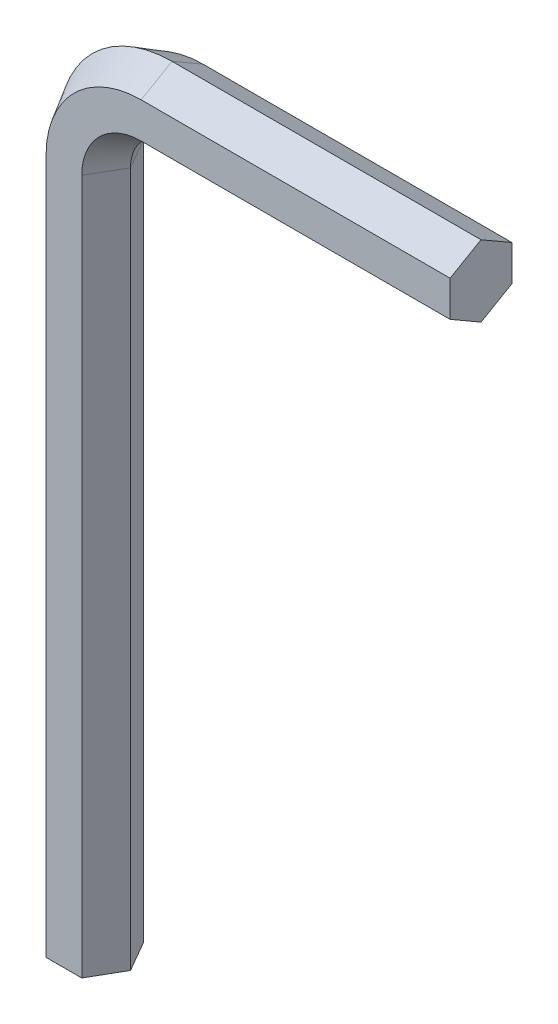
ISO-10303-21;
HEADER;
FILE_DESCRIPTION(('STEP AP214'),'2;1');
FILE_NAME('part.step','',(''),(''),'','','');
FILE_SCHEMA(('AUTOMOTIVE_DESIGN { 1 0 10303 214 1 1 1 1 }'));
ENDSEC;
DATA;
#1=APPLICATION_CONTEXT('core data for automotive mechanical design processes');
#2=APPLICATION_PROTOCOL_DEFINITION('international standard','automotive_design',2000,#1);
#3=PRODUCT_CONTEXT('',#1,'mechanical');
#4=PRODUCT('Part','Part','',(#3));
#5=PRODUCT_RELATED_PRODUCT_CATEGORY('part','',(#4));
#6=PRODUCT_DEFINITION_FORMATION('','',#4);
#7=PRODUCT_DEFINITION_CONTEXT('part definition',#1,'design');
#8=PRODUCT_DEFINITION('design','',#6,#7);
#9=PRODUCT_DEFINITION_SHAPE('','',#8);
#10=(LENGTH_UNIT() NAMED_UNIT(*) SI_UNIT(.MILLI.,.METRE.));
#11=(NAMED_UNIT(*) PLANE_ANGLE_UNIT() SI_UNIT($,.RADIAN.));
#12=(NAMED_UNIT(*) SI_UNIT($,.STERADIAN.) SOLID_ANGLE_UNIT());
#13=UNCERTAINTY_MEASURE_WITH_UNIT(LENGTH_MEASURE(1.E-05),#10,'distance_accuracy_value','');
#14=(GEOMETRIC_REPRESENTATION_CONTEXT(3) GLOBAL_UNCERTAINTY_ASSIGNED_CONTEXT((#13)) GLOBAL_UNIT_ASSIGNED_CONTEXT((#10,
#11,#12)) REPRESENTATION_CONTEXT('',''));
#15=CARTESIAN_POINT('',(0.,0.,0.));
#16=DIRECTION('',(0.,0.,1.));
#17=DIRECTION('',(1.,0.,0.));
#18=AXIS2_PLACEMENT_3D('',#15,#16,#17);
#19=CARTESIAN_POINT('',(5.00000000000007,52.3094010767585,0.));
#20=DIRECTION('',(0.,0.866025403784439,0.5));
#21=DIRECTION('',(0.,-0.5,0.866025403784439));
#22=AXIS2_PLACEMENT_3D('',#19,#20,#21);
#23=PLANE('',#22);
#24=DIRECTION('',(0.,-0.5,0.866025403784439));
#25=VECTOR('',#24,1.);
#26=CARTESIAN_POINT('',(5.00000000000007,52.3094010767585,0.));
#27=LINE('',#26,#25);
#28=CARTESIAN_POINT('',(5.00000000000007,52.3094010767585,0.));
#29=VERTEX_POINT('',#28);
#30=CARTESIAN_POINT('',(5.00000000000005,51.1547005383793,2.));
#31=VERTEX_POINT('',#30);
#32=EDGE_CURVE('E131',#29,#31,#27,.T.);
#33=ORIENTED_EDGE('',*,*,#32,.T.);
#34=DIRECTION('',(1.,0.,0.));
#35=VECTOR('',#34,1.);
#36=CARTESIAN_POINT('',(5.00000000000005,51.1547005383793,2.));
#37=LINE('',#36,#35);
#38=CARTESIAN_POINT('',(25.,51.1547005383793,2.));
#39=VERTEX_POINT('',#38);
#40=EDGE_CURVE('E40',#31,#39,#37,.T.);
#41=ORIENTED_EDGE('',*,*,#40,.T.);
#42=DIRECTION('',(0.,-0.5,0.866025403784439));
#43=VECTOR('',#42,1.);
#44=CARTESIAN_POINT('',(25.,52.3094010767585,0.));
#45=LINE('',#44,#43);
#46=CARTESIAN_POINT('',(25.,52.3094010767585,0.));
#47=VERTEX_POINT('',#46);
#48=EDGE_CURVE('E47',#47,#39,#45,.T.);
#49=ORIENTED_EDGE('',*,*,#48,.F.);
#50=DIRECTION('',(1.,0.,0.));
#51=VECTOR('',#50,1.);
#52=CARTESIAN_POINT('',(5.00000000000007,52.3094010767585,0.));
#53=LINE('',#52,#51);
#54=EDGE_CURVE('E11',#29,#47,#53,.T.);
#55=ORIENTED_EDGE('',*,*,#54,.F.);
#56=EDGE_LOOP('',(#33,#41,#49,#55));
#57=FACE_BOUND('',#56,.T.);
#58=ADVANCED_FACE('F33',(#57),#23,.T.);
#59=CARTESIAN_POINT('',(5.00000000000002,48.8452994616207,2.));
#60=DIRECTION('',(0.,-0.866025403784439,0.5));
#61=DIRECTION('',(0.,-0.5,-0.866025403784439));
#62=AXIS2_PLACEMENT_3D('',#59,#60,#61);
#63=PLANE('',#62);
#64=DIRECTION('',(0.,-0.5,-0.866025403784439));
#65=VECTOR('',#64,1.);
#66=CARTESIAN_POINT('',(5.00000000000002,48.8452994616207,2.));
#67=LINE('',#66,#65);
#68=CARTESIAN_POINT('',(5.00000000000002,48.8452994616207,2.));
#69=VERTEX_POINT('',#68);
#70=CARTESIAN_POINT('',(5.,47.6905989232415,0.));
#71=VERTEX_POINT('',#70);
#72=EDGE_CURVE('E171',#69,#71,#67,.T.);
#73=ORIENTED_EDGE('',*,*,#72,.T.);
#74=DIRECTION('',(1.,0.,0.));
#75=VECTOR('',#74,1.);
#76=CARTESIAN_POINT('',(5.,47.6905989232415,0.));
#77=LINE('',#76,#75);
#78=CARTESIAN_POINT('',(25.,47.6905989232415,0.));
#79=VERTEX_POINT('',#78);
#80=EDGE_CURVE('E204',#71,#79,#77,.T.);
#81=ORIENTED_EDGE('',*,*,#80,.T.);
#82=DIRECTION('',(0.,-0.5,-0.866025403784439));
#83=VECTOR('',#82,1.);
#84=CARTESIAN_POINT('',(25.,48.8452994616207,2.));
#85=LINE('',#84,#83);
#86=CARTESIAN_POINT('',(25.,48.8452994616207,2.));
#87=VERTEX_POINT('',#86);
#88=EDGE_CURVE('E193',#87,#79,#85,.T.);
#89=ORIENTED_EDGE('',*,*,#88,.F.);
#90=DIRECTION('',(1.,0.,0.));
#91=VECTOR('',#90,1.);
#92=CARTESIAN_POINT('',(5.00000000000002,48.8452994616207,2.));
#93=LINE('',#92,#91);
#94=EDGE_CURVE('E207',#69,#87,#93,.T.);
#95=ORIENTED_EDGE('',*,*,#94,.F.);
#96=EDGE_LOOP('',(#73,#81,#89,#95));
#97=FACE_BOUND('',#96,.T.);
#98=ADVANCED_FACE('F245',(#97),#63,.T.);
#99=CARTESIAN_POINT('',(5.,47.6905989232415,0.));
#100=DIRECTION('',(0.,-0.866025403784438,-0.5));
#101=DIRECTION('',(0.,0.5,-0.866025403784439));
#102=AXIS2_PLACEMENT_3D('',#99,#100,#101);
#103=PLANE('',#102);
#104=DIRECTION('',(0.,0.5,-0.866025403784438));
#105=VECTOR('',#104,1.);
#106=CARTESIAN_POINT('',(5.,47.6905989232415,0.));
#107=LINE('',#106,#105);
#108=CARTESIAN_POINT('',(5.00000000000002,48.8452994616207,-2.));
#109=VERTEX_POINT('',#108);
#110=EDGE_CURVE('E163',#71,#109,#107,.T.);
#111=ORIENTED_EDGE('',*,*,#110,.T.);
#112=DIRECTION('',(1.,0.,0.));
#113=VECTOR('',#112,1.);
#114=CARTESIAN_POINT('',(5.00000000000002,48.8452994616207,-2.));
#115=LINE('',#114,#113);
#116=CARTESIAN_POINT('',(25.,48.8452994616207,-2.));
#117=VERTEX_POINT('',#116);
#118=EDGE_CURVE('E201',#109,#117,#115,.T.);
#119=ORIENTED_EDGE('',*,*,#118,.T.);
#120=DIRECTION('',(0.,0.5,-0.866025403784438));
#121=VECTOR('',#120,1.);
#122=CARTESIAN_POINT('',(25.,47.6905989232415,0.));
#123=LINE('',#122,#121);
#124=EDGE_CURVE('E190',#79,#117,#123,.T.);
#125=ORIENTED_EDGE('',*,*,#124,.F.);
#126=ORIENTED_EDGE('',*,*,#80,.F.);
#127=EDGE_LOOP('',(#111,#119,#125,#126));
#128=FACE_BOUND('',#127,.T.);
#129=ADVANCED_FACE('F250',(#128),#103,.T.);
#130=CARTESIAN_POINT('',(5.00000000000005,51.1547005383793,-2.));
#131=DIRECTION('',(0.,0.866025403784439,-0.499999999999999));
#132=DIRECTION('',(0.,0.5,0.866025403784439));
#133=AXIS2_PLACEMENT_3D('',#130,#131,#132);
#134=PLANE('',#133);
#135=DIRECTION('',(0.,0.499999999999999,0.866025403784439));
#136=VECTOR('',#135,1.);
#137=CARTESIAN_POINT('',(5.00000000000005,51.1547005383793,-2.));
#138=LINE('',#137,#136);
#139=CARTESIAN_POINT('',(5.00000000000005,51.1547005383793,-2.));
#140=VERTEX_POINT('',#139);
#141=EDGE_CURVE('E160',#140,#29,#138,.T.);
#142=ORIENTED_EDGE('',*,*,#141,.T.);
#143=ORIENTED_EDGE('',*,*,#54,.T.);
#144=DIRECTION('',(0.,0.499999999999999,0.866025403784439));
#145=VECTOR('',#144,1.);
#146=CARTESIAN_POINT('',(25.,51.1547005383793,-2.));
#147=LINE('',#146,#145);
#148=CARTESIAN_POINT('',(25.,51.1547005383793,-2.));
#149=VERTEX_POINT('',#148);
#150=EDGE_CURVE('E134',#149,#47,#147,.T.);
#151=ORIENTED_EDGE('',*,*,#150,.F.);
#152=DIRECTION('',(1.,0.,0.));
#153=VECTOR('',#152,1.);
#154=CARTESIAN_POINT('',(5.00000000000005,51.1547005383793,-2.));
#155=LINE('',#154,#153);
#156=EDGE_CURVE('E198',#140,#149,#155,.T.);
#157=ORIENTED_EDGE('',*,*,#156,.F.);
#158=EDGE_LOOP('',(#142,#143,#151,#157));
#159=FACE_BOUND('',#158,.T.);
#160=ADVANCED_FACE('F254',(#159),#134,.T.);
#161=CARTESIAN_POINT('',(5.,45.,0.));
#162=DIRECTION('',(0.,0.,-1.));
#163=DIRECTION('',(-1.,0.,0.));
#164=AXIS2_PLACEMENT_3D('',#161,#162,#163);
#165=CONICAL_SURFACE('',#164,7.3094010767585,0.523598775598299);
#166=DIRECTION('',(0.5,0.,0.866025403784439));
#167=VECTOR('',#166,1.);
#168=CARTESIAN_POINT('',(-2.3094010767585,45.,0.));
#169=LINE('',#168,#167);
#170=CARTESIAN_POINT('',(-2.3094010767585,45.,0.));
#171=VERTEX_POINT('',#170);
#172=CARTESIAN_POINT('',(-1.15470053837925,45.,2.));
#173=VERTEX_POINT('',#172);
#174=EDGE_CURVE('E128',#171,#173,#169,.T.);
#175=ORIENTED_EDGE('',*,*,#174,.T.);
#176=CARTESIAN_POINT('',(5.,45.,2.));
#177=DIRECTION('',(0.,0.,-1.));
#178=DIRECTION('',(-1.,0.,0.));
#179=AXIS2_PLACEMENT_3D('',#176,#177,#178);
#180=CIRCLE('',#179,6.15470053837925);
#181=EDGE_CURVE('E135',#173,#31,#180,.T.);
#182=ORIENTED_EDGE('',*,*,#181,.T.);
#183=ORIENTED_EDGE('',*,*,#32,.F.);
#184=CARTESIAN_POINT('',(5.,45.,0.));
#185=DIRECTION('',(0.,0.,-1.));
#186=DIRECTION('',(-1.,0.,0.));
#187=AXIS2_PLACEMENT_3D('',#184,#185,#186);
#188=CIRCLE('',#187,7.3094010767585);
#189=EDGE_CURVE('E123',#171,#29,#188,.T.);
#190=ORIENTED_EDGE('',*,*,#189,.F.);
#191=EDGE_LOOP('',(#175,#182,#183,#190));
#192=FACE_BOUND('',#191,.T.);
#193=ADVANCED_FACE('F125',(#192),#165,.T.);
#194=CARTESIAN_POINT('',(5.,45.,2.));
#195=DIRECTION('',(0.,0.,1.));
#196=DIRECTION('',(1.,0.,0.));
#197=AXIS2_PLACEMENT_3D('',#194,#195,#196);
#198=CONICAL_SURFACE('',#197,3.84529946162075,0.523598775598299);
#199=DIRECTION('',(0.5,0.,-0.866025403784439));
#200=VECTOR('',#199,1.);
#201=CARTESIAN_POINT('',(1.15470053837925,45.,2.));
#202=LINE('',#201,#200);
#203=CARTESIAN_POINT('',(1.15470053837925,45.,2.));
#204=VERTEX_POINT('',#203);
#205=CARTESIAN_POINT('',(2.3094010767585,45.,0.));
#206=VERTEX_POINT('',#205);
#207=EDGE_CURVE('E155',#204,#206,#202,.T.);
#208=ORIENTED_EDGE('',*,*,#207,.T.);
#209=CARTESIAN_POINT('',(5.,45.,0.));
#210=DIRECTION('',(0.,0.,-1.));
#211=DIRECTION('',(-1.,0.,0.));
#212=AXIS2_PLACEMENT_3D('',#209,#210,#211);
#213=CIRCLE('',#212,2.6905989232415);
#214=EDGE_CURVE('E179',#206,#71,#213,.T.);
#215=ORIENTED_EDGE('',*,*,#214,.T.);
#216=ORIENTED_EDGE('',*,*,#72,.F.);
#217=CARTESIAN_POINT('',(5.,45.,2.));
#218=DIRECTION('',(0.,0.,-1.));
#219=DIRECTION('',(-1.,0.,0.));
#220=AXIS2_PLACEMENT_3D('',#217,#218,#219);
#221=CIRCLE('',#220,3.84529946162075);
#222=EDGE_CURVE('E182',#204,#69,#221,.T.);
#223=ORIENTED_EDGE('',*,*,#222,.F.);
#224=EDGE_LOOP('',(#208,#215,#216,#223));
#225=FACE_BOUND('',#224,.T.);
#226=ADVANCED_FACE('F242',(#225),#198,.F.);
#227=CARTESIAN_POINT('',(5.,45.,0.));
#228=DIRECTION('',(0.,0.,-1.));
#229=DIRECTION('',(-1.,0.,0.));
#230=AXIS2_PLACEMENT_3D('',#227,#228,#229);
#231=CONICAL_SURFACE('',#230,2.6905989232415,0.523598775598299);
#232=DIRECTION('',(-0.5,0.,-0.866025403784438));
#233=VECTOR('',#232,1.);
#234=CARTESIAN_POINT('',(2.3094010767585,45.,0.));
#235=LINE('',#234,#233);
#236=CARTESIAN_POINT('',(1.15470053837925,45.,-2.));
#237=VERTEX_POINT('',#236);
#238=EDGE_CURVE('E230',#206,#237,#235,.T.);
#239=ORIENTED_EDGE('',*,*,#238,.T.);
#240=CARTESIAN_POINT('',(5.,45.,-2.));
#241=DIRECTION('',(0.,0.,-1.));
#242=DIRECTION('',(-1.,0.,0.));
#243=AXIS2_PLACEMENT_3D('',#240,#241,#242);
#244=CIRCLE('',#243,3.84529946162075);
#245=EDGE_CURVE('E176',#237,#109,#244,.T.);
#246=ORIENTED_EDGE('',*,*,#245,.T.);
#247=ORIENTED_EDGE('',*,*,#110,.F.);
#248=ORIENTED_EDGE('',*,*,#214,.F.);
#249=EDGE_LOOP('',(#239,#246,#247,#248));
#250=FACE_BOUND('',#249,.T.);
#251=ADVANCED_FACE('F248',(#250),#231,.F.);
#252=CARTESIAN_POINT('',(5.,45.,-2.));
#253=DIRECTION('',(0.,0.,1.));
#254=DIRECTION('',(1.,0.,0.));
#255=AXIS2_PLACEMENT_3D('',#252,#253,#254);
#256=CONICAL_SURFACE('',#255,6.15470053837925,0.523598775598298);
#257=DIRECTION('',(-0.499999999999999,0.,0.866025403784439));
#258=VECTOR('',#257,1.);
#259=CARTESIAN_POINT('',(-1.15470053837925,45.,-2.));
#260=LINE('',#259,#258);
#261=CARTESIAN_POINT('',(-1.15470053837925,45.,-2.));
#262=VERTEX_POINT('',#261);
#263=EDGE_CURVE('E138',#262,#171,#260,.T.);
#264=ORIENTED_EDGE('',*,*,#263,.T.);
#265=ORIENTED_EDGE('',*,*,#189,.T.);
#266=ORIENTED_EDGE('',*,*,#141,.F.);
#267=CARTESIAN_POINT('',(5.,45.,-2.));
#268=DIRECTION('',(0.,0.,-1.));
#269=DIRECTION('',(-1.,0.,0.));
#270=AXIS2_PLACEMENT_3D('',#267,#268,#269);
#271=CIRCLE('',#270,6.15470053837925);
#272=EDGE_CURVE('E141',#262,#140,#271,.T.);
#273=ORIENTED_EDGE('',*,*,#272,.F.);
#274=EDGE_LOOP('',(#264,#265,#266,#273));
#275=FACE_BOUND('',#274,.T.);
#276=ADVANCED_FACE('F139',(#275),#256,.T.);
#277=CARTESIAN_POINT('',(-1.15470053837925,45.,-2.));
#278=DIRECTION('',(0.866025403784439,0.,0.499999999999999));
#279=DIRECTION('',(0.499999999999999,0.,-0.866025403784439));
#280=AXIS2_PLACEMENT_3D('',#277,#278,#279);
#281=PLANE('',#280);
#282=DIRECTION('',(-0.499999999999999,0.,0.866025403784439));
#283=VECTOR('',#282,1.);
#284=CARTESIAN_POINT('',(-1.15470053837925,0.,-2.));
#285=LINE('',#284,#283);
#286=CARTESIAN_POINT('',(-1.15470053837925,0.,-2.));
#287=VERTEX_POINT('',#286);
#288=CARTESIAN_POINT('',(-2.3094010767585,0.,0.));
#289=VERTEX_POINT('',#288);
#290=EDGE_CURVE('E159',#287,#289,#285,.T.);
#291=ORIENTED_EDGE('',*,*,#290,.T.);
#292=DIRECTION('',(0.,-1.,0.));
#293=VECTOR('',#292,1.);
#294=CARTESIAN_POINT('',(-2.3094010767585,45.,0.));
#295=LINE('',#294,#293);
#296=EDGE_CURVE('E151',#171,#289,#295,.T.);
#297=ORIENTED_EDGE('',*,*,#296,.F.);
#298=ORIENTED_EDGE('',*,*,#263,.F.);
#299=DIRECTION('',(0.,-1.,0.));
#300=VECTOR('',#299,1.);
#301=CARTESIAN_POINT('',(-1.15470053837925,45.,-2.));
#302=LINE('',#301,#300);
#303=EDGE_CURVE('E227',#262,#287,#302,.T.);
#304=ORIENTED_EDGE('',*,*,#303,.T.);
#305=EDGE_LOOP('',(#291,#297,#298,#304));
#306=FACE_BOUND('',#305,.T.);
#307=ADVANCED_FACE('F157',(#306),#281,.F.);
#308=CARTESIAN_POINT('',(-2.3094010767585,45.,0.));
#309=DIRECTION('',(0.866025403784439,0.,-0.5));
#310=DIRECTION('',(-0.5,0.,-0.866025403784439));
#311=AXIS2_PLACEMENT_3D('',#308,#309,#310);
#312=PLANE('',#311);
#313=DIRECTION('',(0.5,0.,0.866025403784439));
#314=VECTOR('',#313,1.);
#315=CARTESIAN_POINT('',(-2.3094010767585,0.,0.));
#316=LINE('',#315,#314);
#317=CARTESIAN_POINT('',(-1.15470053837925,0.,2.));
#318=VERTEX_POINT('',#317);
#319=EDGE_CURVE('E216',#289,#318,#316,.T.);
#320=ORIENTED_EDGE('',*,*,#319,.T.);
#321=DIRECTION('',(0.,-1.,0.));
#322=VECTOR('',#321,1.);
#323=CARTESIAN_POINT('',(-1.15470053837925,45.,2.));
#324=LINE('',#323,#322);
#325=EDGE_CURVE('E154',#173,#318,#324,.T.);
#326=ORIENTED_EDGE('',*,*,#325,.F.);
#327=ORIENTED_EDGE('',*,*,#174,.F.);
#328=ORIENTED_EDGE('',*,*,#296,.T.);
#329=EDGE_LOOP('',(#320,#326,#327,#328));
#330=FACE_BOUND('',#329,.T.);
#331=ADVANCED_FACE('F150',(#330),#312,.F.);
#332=CARTESIAN_POINT('',(-1.15470053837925,45.,2.));
#333=DIRECTION('',(0.,0.,-1.));
#334=DIRECTION('',(-1.,0.,0.));
#335=AXIS2_PLACEMENT_3D('',#332,#333,#334);
#336=PLANE('',#335);
#337=DIRECTION('',(1.,0.,0.));
#338=VECTOR('',#337,1.);
#339=CARTESIAN_POINT('',(-1.15470053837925,0.,2.));
#340=LINE('',#339,#338);
#341=CARTESIAN_POINT('',(1.15470053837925,0.,2.));
#342=VERTEX_POINT('',#341);
#343=EDGE_CURVE('E211',#318,#342,#340,.T.);
#344=ORIENTED_EDGE('',*,*,#343,.T.);
#345=DIRECTION('',(0.,-1.,0.));
#346=VECTOR('',#345,1.);
#347=CARTESIAN_POINT('',(1.15470053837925,45.,2.));
#348=LINE('',#347,#346);
#349=EDGE_CURVE('E165',#204,#342,#348,.T.);
#350=ORIENTED_EDGE('',*,*,#349,.F.);
#351=ORIENTED_EDGE('',*,*,#222,.T.);
#352=ORIENTED_EDGE('',*,*,#94,.T.);
#353=DIRECTION('',(0.,-1.,0.));
#354=VECTOR('',#353,1.);
#355=CARTESIAN_POINT('',(25.,51.1547005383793,2.));
#356=LINE('',#355,#354);
#357=EDGE_CURVE('E55',#39,#87,#356,.T.);
#358=ORIENTED_EDGE('',*,*,#357,.F.);
#359=ORIENTED_EDGE('',*,*,#40,.F.);
#360=ORIENTED_EDGE('',*,*,#181,.F.);
#361=ORIENTED_EDGE('',*,*,#325,.T.);
#362=EDGE_LOOP('',(#344,#350,#351,#352,#358,#359,#360,#361));
#363=FACE_BOUND('',#362,.T.);
#364=ADVANCED_FACE('F208',(#363),#336,.F.);
#365=CARTESIAN_POINT('',(1.15470053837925,45.,2.));
#366=DIRECTION('',(-0.866025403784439,0.,-0.5));
#367=DIRECTION('',(-0.5,0.,0.866025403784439));
#368=AXIS2_PLACEMENT_3D('',#365,#366,#367);
#369=PLANE('',#368);
#370=DIRECTION('',(0.5,0.,-0.866025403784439));
#371=VECTOR('',#370,1.);
#372=CARTESIAN_POINT('',(1.15470053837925,0.,2.));
#373=LINE('',#372,#371);
#374=CARTESIAN_POINT('',(2.3094010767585,0.,0.));
#375=VERTEX_POINT('',#374);
#376=EDGE_CURVE('E218',#342,#375,#373,.T.);
#377=ORIENTED_EDGE('',*,*,#376,.T.);
#378=DIRECTION('',(0.,-1.,0.));
#379=VECTOR('',#378,1.);
#380=CARTESIAN_POINT('',(2.3094010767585,45.,0.));
#381=LINE('',#380,#379);
#382=EDGE_CURVE('E233',#206,#375,#381,.T.);
#383=ORIENTED_EDGE('',*,*,#382,.F.);
#384=ORIENTED_EDGE('',*,*,#207,.F.);
#385=ORIENTED_EDGE('',*,*,#349,.T.);
#386=EDGE_LOOP('',(#377,#383,#384,#385));
#387=FACE_BOUND('',#386,.T.);
#388=ADVANCED_FACE('F237',(#387),#369,.F.);
#389=CARTESIAN_POINT('',(2.3094010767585,45.,0.));
#390=DIRECTION('',(-0.866025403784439,0.,0.5));
#391=DIRECTION('',(0.5,0.,0.866025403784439));
#392=AXIS2_PLACEMENT_3D('',#389,#390,#391);
#393=PLANE('',#392);
#394=DIRECTION('',(-0.5,0.,-0.866025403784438));
#395=VECTOR('',#394,1.);
#396=CARTESIAN_POINT('',(2.3094010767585,0.,0.));
#397=LINE('',#396,#395);
#398=CARTESIAN_POINT('',(1.15470053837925,0.,-2.));
#399=VERTEX_POINT('',#398);
#400=EDGE_CURVE('E220',#375,#399,#397,.T.);
#401=ORIENTED_EDGE('',*,*,#400,.T.);
#402=DIRECTION('',(0.,-1.,0.));
#403=VECTOR('',#402,1.);
#404=CARTESIAN_POINT('',(1.15470053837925,45.,-2.));
#405=LINE('',#404,#403);
#406=EDGE_CURVE('E229',#237,#399,#405,.T.);
#407=ORIENTED_EDGE('',*,*,#406,.F.);
#408=ORIENTED_EDGE('',*,*,#238,.F.);
#409=ORIENTED_EDGE('',*,*,#382,.T.);
#410=EDGE_LOOP('',(#401,#407,#408,#409));
#411=FACE_BOUND('',#410,.T.);
#412=ADVANCED_FACE('F263',(#411),#393,.F.);
#413=CARTESIAN_POINT('',(1.15470053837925,45.,-2.));
#414=DIRECTION('',(0.,0.,1.));
#415=DIRECTION('',(1.,0.,0.));
#416=AXIS2_PLACEMENT_3D('',#413,#414,#415);
#417=PLANE('',#416);
#418=DIRECTION('',(-1.,0.,0.));
#419=VECTOR('',#418,1.);
#420=CARTESIAN_POINT('',(1.15470053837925,0.,-2.));
#421=LINE('',#420,#419);
#422=EDGE_CURVE('E146',#399,#287,#421,.T.);
#423=ORIENTED_EDGE('',*,*,#422,.T.);
#424=ORIENTED_EDGE('',*,*,#303,.F.);
#425=ORIENTED_EDGE('',*,*,#272,.T.);
#426=ORIENTED_EDGE('',*,*,#156,.T.);
#427=DIRECTION('',(0.,1.,0.));
#428=VECTOR('',#427,1.);
#429=CARTESIAN_POINT('',(25.,48.8452994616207,-2.));
#430=LINE('',#429,#428);
#431=EDGE_CURVE('E187',#117,#149,#430,.T.);
#432=ORIENTED_EDGE('',*,*,#431,.F.);
#433=ORIENTED_EDGE('',*,*,#118,.F.);
#434=ORIENTED_EDGE('',*,*,#245,.F.);
#435=ORIENTED_EDGE('',*,*,#406,.T.);
#436=EDGE_LOOP('',(#423,#424,#425,#426,#432,#433,#434,#435));
#437=FACE_BOUND('',#436,.T.);
#438=ADVANCED_FACE('F256',(#437),#417,.F.);
#439=CARTESIAN_POINT('',(25.,52.3094010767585,0.));
#440=DIRECTION('',(1.,0.,0.));
#441=DIRECTION('',(0.,0.,1.));
#442=AXIS2_PLACEMENT_3D('',#439,#440,#441);
#443=PLANE('',#442);
#444=ORIENTED_EDGE('',*,*,#150,.T.);
#445=ORIENTED_EDGE('',*,*,#48,.T.);
#446=ORIENTED_EDGE('',*,*,#357,.T.);
#447=ORIENTED_EDGE('',*,*,#88,.T.);
#448=ORIENTED_EDGE('',*,*,#124,.T.);
#449=ORIENTED_EDGE('',*,*,#431,.T.);
#450=EDGE_LOOP('',(#444,#445,#446,#447,#448,#449));
#451=FACE_BOUND('',#450,.T.);
#452=ADVANCED_FACE('F252',(#451),#443,.T.);
#453=CARTESIAN_POINT('',(-2.3094010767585,0.,0.));
#454=DIRECTION('',(0.,1.,0.));
#455=DIRECTION('',(0.,0.,1.));
#456=AXIS2_PLACEMENT_3D('',#453,#454,#455);
#457=PLANE('',#456);
#458=ORIENTED_EDGE('',*,*,#290,.F.);
#459=ORIENTED_EDGE('',*,*,#422,.F.);
#460=ORIENTED_EDGE('',*,*,#400,.F.);
#461=ORIENTED_EDGE('',*,*,#376,.F.);
#462=ORIENTED_EDGE('',*,*,#343,.F.);
#463=ORIENTED_EDGE('',*,*,#319,.F.);
#464=EDGE_LOOP('',(#458,#459,#460,#461,#462,#463));
#465=FACE_BOUND('',#464,.T.);
#466=ADVANCED_FACE('F215',(#465),#457,.F.);
#467=CLOSED_SHELL('',(#58,#98,#129,#160,#193,#226,#251,#276,#307,#331,#364,#388,#412,#438,#452,#466));
#468=MANIFOLD_SOLID_BREP('B2',#467);
#469=ADVANCED_BREP_SHAPE_REPRESENTATION('',(#18,#468),#14);
#470=SHAPE_DEFINITION_REPRESENTATION(#9,#469);
ENDSEC;
END-ISO-10303-21;
